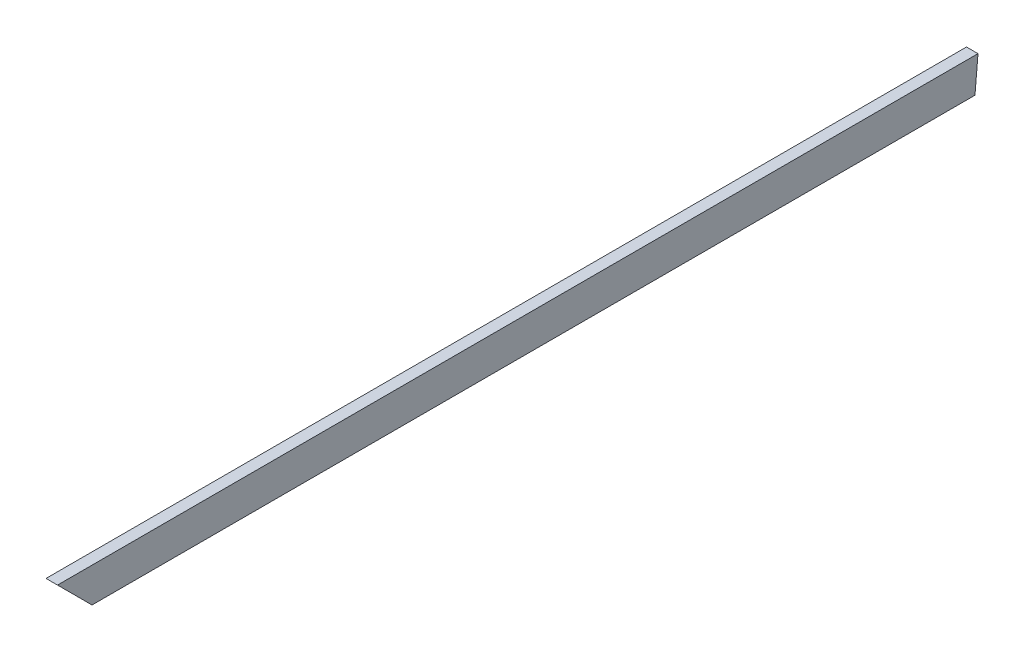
ISO-10303-21;
HEADER;
FILE_DESCRIPTION(('STEP AP214'),'2;1');
FILE_NAME('part.step','',(''),(''),'','','');
FILE_SCHEMA(('AUTOMOTIVE_DESIGN { 1 0 10303 214 1 1 1 1 }'));
ENDSEC;
DATA;
#1=APPLICATION_CONTEXT('core data for automotive mechanical design processes');
#2=APPLICATION_PROTOCOL_DEFINITION('international standard','automotive_design',2000,#1);
#3=PRODUCT_CONTEXT('',#1,'mechanical');
#4=PRODUCT('Part','Part','',(#3));
#5=PRODUCT_RELATED_PRODUCT_CATEGORY('part','',(#4));
#6=PRODUCT_DEFINITION_FORMATION('','',#4);
#7=PRODUCT_DEFINITION_CONTEXT('part definition',#1,'design');
#8=PRODUCT_DEFINITION('design','',#6,#7);
#9=PRODUCT_DEFINITION_SHAPE('','',#8);
#10=(LENGTH_UNIT() NAMED_UNIT(*) SI_UNIT(.MILLI.,.METRE.));
#11=(NAMED_UNIT(*) PLANE_ANGLE_UNIT() SI_UNIT($,.RADIAN.));
#12=(NAMED_UNIT(*) SI_UNIT($,.STERADIAN.) SOLID_ANGLE_UNIT());
#13=UNCERTAINTY_MEASURE_WITH_UNIT(LENGTH_MEASURE(1.E-05),#10,'distance_accuracy_value','');
#14=(GEOMETRIC_REPRESENTATION_CONTEXT(3) GLOBAL_UNCERTAINTY_ASSIGNED_CONTEXT((#13)) GLOBAL_UNIT_ASSIGNED_CONTEXT((#10,
#11,#12)) REPRESENTATION_CONTEXT('',''));
#15=CARTESIAN_POINT('',(0.,0.,0.));
#16=DIRECTION('',(0.,0.,1.));
#17=DIRECTION('',(1.,0.,0.));
#18=AXIS2_PLACEMENT_3D('',#15,#16,#17);
#19=CARTESIAN_POINT('',(0.,0.,2000.));
#20=DIRECTION('',(1.,0.,0.));
#21=DIRECTION('',(0.,0.,-1.));
#22=AXIS2_PLACEMENT_3D('',#19,#20,#21);
#23=PLANE('',#22);
#24=DIRECTION('',(0.,0.,-1.));
#25=VECTOR('',#24,1.);
#26=CARTESIAN_POINT('',(0.,150.,2000.));
#27=LINE('',#26,#25);
#28=CARTESIAN_POINT('',(0.,150.,2000.));
#29=VERTEX_POINT('',#28);
#30=CARTESIAN_POINT('',(0.,150.,-2000.));
#31=VERTEX_POINT('',#30);
#32=EDGE_CURVE('E120',#29,#31,#27,.T.);
#33=ORIENTED_EDGE('',*,*,#32,.T.);
#34=DIRECTION('',(0.,-0.996194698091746,0.0871557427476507));
#35=VECTOR('',#34,1.);
#36=CARTESIAN_POINT('',(0.,0.,-1986.87670047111));
#37=LINE('',#36,#35);
#38=CARTESIAN_POINT('',(0.,0.,-1986.87670047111));
#39=VERTEX_POINT('',#38);
#40=EDGE_CURVE('E104',#31,#39,#37,.T.);
#41=ORIENTED_EDGE('',*,*,#40,.T.);
#42=DIRECTION('',(0.,0.,-1.));
#43=VECTOR('',#42,1.);
#44=CARTESIAN_POINT('',(0.,0.,2000.));
#45=LINE('',#44,#43);
#46=CARTESIAN_POINT('',(0.,0.,1850.));
#47=VERTEX_POINT('',#46);
#48=EDGE_CURVE('E118',#47,#39,#45,.T.);
#49=ORIENTED_EDGE('',*,*,#48,.F.);
#50=DIRECTION('',(0.,0.707106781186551,0.707106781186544));
#51=VECTOR('',#50,1.);
#52=CARTESIAN_POINT('',(0.,0.,1850.));
#53=LINE('',#52,#51);
#54=EDGE_CURVE('E162',#47,#29,#53,.T.);
#55=ORIENTED_EDGE('',*,*,#54,.T.);
#56=EDGE_LOOP('',(#33,#41,#49,#55));
#57=FACE_BOUND('',#56,.T.);
#58=ADVANCED_FACE('F33',(#57),#23,.F.);
#59=CARTESIAN_POINT('',(0.,0.,2000.));
#60=DIRECTION('',(0.,1.,0.));
#61=DIRECTION('',(0.,0.,1.));
#62=AXIS2_PLACEMENT_3D('',#59,#60,#61);
#63=PLANE('',#62);
#64=ORIENTED_EDGE('',*,*,#48,.T.);
#65=DIRECTION('',(1.,0.,0.));
#66=VECTOR('',#65,1.);
#67=CARTESIAN_POINT('',(0.,0.,-1986.87670047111));
#68=LINE('',#67,#66);
#69=CARTESIAN_POINT('',(50.,0.,-1986.87670047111));
#70=VERTEX_POINT('',#69);
#71=EDGE_CURVE('E101',#39,#70,#68,.T.);
#72=ORIENTED_EDGE('',*,*,#71,.T.);
#73=DIRECTION('',(0.,0.,-1.));
#74=VECTOR('',#73,1.);
#75=CARTESIAN_POINT('',(50.,0.,2000.));
#76=LINE('',#75,#74);
#77=CARTESIAN_POINT('',(50.,0.,1850.));
#78=VERTEX_POINT('',#77);
#79=EDGE_CURVE('E125',#78,#70,#76,.T.);
#80=ORIENTED_EDGE('',*,*,#79,.F.);
#81=DIRECTION('',(1.,0.,0.));
#82=VECTOR('',#81,1.);
#83=CARTESIAN_POINT('',(0.,0.,1850.));
#84=LINE('',#83,#82);
#85=EDGE_CURVE('E124',#47,#78,#84,.T.);
#86=ORIENTED_EDGE('',*,*,#85,.F.);
#87=EDGE_LOOP('',(#64,#72,#80,#86));
#88=FACE_BOUND('',#87,.T.);
#89=ADVANCED_FACE('F123',(#88),#63,.F.);
#90=CARTESIAN_POINT('',(50.,0.,2000.));
#91=DIRECTION('',(-1.,0.,0.));
#92=DIRECTION('',(0.,0.,1.));
#93=AXIS2_PLACEMENT_3D('',#90,#91,#92);
#94=PLANE('',#93);
#95=ORIENTED_EDGE('',*,*,#79,.T.);
#96=DIRECTION('',(0.,-0.996194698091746,0.0871557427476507));
#97=VECTOR('',#96,1.);
#98=CARTESIAN_POINT('',(50.,0.,-1986.87670047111));
#99=LINE('',#98,#97);
#100=CARTESIAN_POINT('',(50.,150.,-2000.));
#101=VERTEX_POINT('',#100);
#102=EDGE_CURVE('E107',#101,#70,#99,.T.);
#103=ORIENTED_EDGE('',*,*,#102,.F.);
#104=DIRECTION('',(0.,0.,-1.));
#105=VECTOR('',#104,1.);
#106=CARTESIAN_POINT('',(50.,150.,2000.));
#107=LINE('',#106,#105);
#108=CARTESIAN_POINT('',(50.,150.,2000.));
#109=VERTEX_POINT('',#108);
#110=EDGE_CURVE('E127',#109,#101,#107,.T.);
#111=ORIENTED_EDGE('',*,*,#110,.F.);
#112=DIRECTION('',(0.,0.707106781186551,0.707106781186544));
#113=VECTOR('',#112,1.);
#114=CARTESIAN_POINT('',(50.,0.,1850.));
#115=LINE('',#114,#113);
#116=EDGE_CURVE('E163',#78,#109,#115,.T.);
#117=ORIENTED_EDGE('',*,*,#116,.F.);
#118=EDGE_LOOP('',(#95,#103,#111,#117));
#119=FACE_BOUND('',#118,.T.);
#120=ADVANCED_FACE('F207',(#119),#94,.F.);
#121=CARTESIAN_POINT('',(0.,150.,2000.));
#122=DIRECTION('',(0.,-1.,0.));
#123=DIRECTION('',(0.,0.,-1.));
#124=AXIS2_PLACEMENT_3D('',#121,#122,#123);
#125=PLANE('',#124);
#126=DIRECTION('',(-1.,0.,0.));
#127=VECTOR('',#126,1.);
#128=CARTESIAN_POINT('',(0.,150.,-2000.));
#129=LINE('',#128,#127);
#130=EDGE_CURVE('E134',#101,#31,#129,.T.);
#131=ORIENTED_EDGE('',*,*,#130,.T.);
#132=ORIENTED_EDGE('',*,*,#32,.F.);
#133=DIRECTION('',(-1.,0.,0.));
#134=VECTOR('',#133,1.);
#135=CARTESIAN_POINT('',(0.,150.,2000.));
#136=LINE('',#135,#134);
#137=EDGE_CURVE('E133',#109,#29,#136,.T.);
#138=ORIENTED_EDGE('',*,*,#137,.F.);
#139=ORIENTED_EDGE('',*,*,#110,.T.);
#140=EDGE_LOOP('',(#131,#132,#138,#139));
#141=FACE_BOUND('',#140,.T.);
#142=ADVANCED_FACE('F200',(#141),#125,.F.);
#143=CARTESIAN_POINT('',(0.,0.,1850.));
#144=DIRECTION('',(0.,0.707106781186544,-0.707106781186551));
#145=DIRECTION('',(0.,0.707106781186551,0.707106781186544));
#146=AXIS2_PLACEMENT_3D('',#143,#144,#145);
#147=PLANE('',#146);
#148=DIRECTION('',(0.,0.707106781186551,0.707106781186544));
#149=VECTOR('',#148,1.);
#150=CARTESIAN_POINT('',(4.,74.9999999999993,1925.));
#151=LINE('',#150,#149);
#152=CARTESIAN_POINT('',(4.,4.,1854.));
#153=VERTEX_POINT('',#152);
#154=CARTESIAN_POINT('',(4.,146.,1996.));
#155=VERTEX_POINT('',#154);
#156=EDGE_CURVE('E54',#153,#155,#151,.T.);
#157=ORIENTED_EDGE('',*,*,#156,.T.);
#158=DIRECTION('',(1.,0.,0.));
#159=VECTOR('',#158,1.);
#160=CARTESIAN_POINT('',(0.,146.,1996.));
#161=LINE('',#160,#159);
#162=CARTESIAN_POINT('',(46.,146.,1996.));
#163=VERTEX_POINT('',#162);
#164=EDGE_CURVE('E40',#155,#163,#161,.T.);
#165=ORIENTED_EDGE('',*,*,#164,.T.);
#166=DIRECTION('',(0.,-0.707106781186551,-0.707106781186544));
#167=VECTOR('',#166,1.);
#168=CARTESIAN_POINT('',(46.,74.9999999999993,1925.));
#169=LINE('',#168,#167);
#170=CARTESIAN_POINT('',(46.,4.,1854.));
#171=VERTEX_POINT('',#170);
#172=EDGE_CURVE('E159',#163,#171,#169,.T.);
#173=ORIENTED_EDGE('',*,*,#172,.T.);
#174=DIRECTION('',(-1.,0.,0.));
#175=VECTOR('',#174,1.);
#176=CARTESIAN_POINT('',(0.,4.,1854.));
#177=LINE('',#176,#175);
#178=EDGE_CURVE('E157',#171,#153,#177,.T.);
#179=ORIENTED_EDGE('',*,*,#178,.T.);
#180=EDGE_LOOP('',(#157,#165,#173,#179));
#181=FACE_BOUND('',#180,.T.);
#182=ORIENTED_EDGE('',*,*,#116,.T.);
#183=ORIENTED_EDGE('',*,*,#137,.T.);
#184=ORIENTED_EDGE('',*,*,#54,.F.);
#185=ORIENTED_EDGE('',*,*,#85,.T.);
#186=EDGE_LOOP('',(#182,#183,#184,#185));
#187=FACE_BOUND('',#186,.T.);
#188=ADVANCED_FACE('F181',(#181,#187),#147,.F.);
#189=CARTESIAN_POINT('',(0.,0.,-1996.));
#190=DIRECTION('',(0.,0.,-1.));
#191=DIRECTION('',(-1.,0.,0.));
#192=AXIS2_PLACEMENT_3D('',#189,#190,#191);
#193=PLANE('',#192);
#194=DIRECTION('',(0.,-1.,0.));
#195=VECTOR('',#194,1.);
#196=CARTESIAN_POINT('',(4.,0.,-1996.));
#197=LINE('',#196,#195);
#198=CARTESIAN_POINT('',(4.,146.,-1996.));
#199=VERTEX_POINT('',#198);
#200=CARTESIAN_POINT('',(4.,104.279790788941,-1996.));
#201=VERTEX_POINT('',#200);
#202=EDGE_CURVE('E148',#199,#201,#197,.T.);
#203=ORIENTED_EDGE('',*,*,#202,.T.);
#204=DIRECTION('',(1.,0.,0.));
#205=VECTOR('',#204,1.);
#206=CARTESIAN_POINT('',(0.,104.279790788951,-1996.));
#207=LINE('',#206,#205);
#208=CARTESIAN_POINT('',(46.,104.279790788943,-1996.));
#209=VERTEX_POINT('',#208);
#210=EDGE_CURVE('E46',#201,#209,#207,.T.);
#211=ORIENTED_EDGE('',*,*,#210,.T.);
#212=DIRECTION('',(0.,1.,0.));
#213=VECTOR('',#212,1.);
#214=CARTESIAN_POINT('',(46.,0.,-1996.));
#215=LINE('',#214,#213);
#216=CARTESIAN_POINT('',(46.,146.,-1996.));
#217=VERTEX_POINT('',#216);
#218=EDGE_CURVE('E142',#209,#217,#215,.T.);
#219=ORIENTED_EDGE('',*,*,#218,.T.);
#220=DIRECTION('',(-1.,0.,0.));
#221=VECTOR('',#220,1.);
#222=CARTESIAN_POINT('',(0.,146.,-1996.));
#223=LINE('',#222,#221);
#224=EDGE_CURVE('E138',#217,#199,#223,.T.);
#225=ORIENTED_EDGE('',*,*,#224,.T.);
#226=EDGE_LOOP('',(#203,#211,#219,#225));
#227=FACE_BOUND('',#226,.T.);
#228=ADVANCED_FACE('F192',(#227),#193,.F.);
#229=CARTESIAN_POINT('',(0.,146.,2000.));
#230=DIRECTION('',(0.,-1.,0.));
#231=DIRECTION('',(0.,0.,-1.));
#232=AXIS2_PLACEMENT_3D('',#229,#230,#231);
#233=PLANE('',#232);
#234=ORIENTED_EDGE('',*,*,#164,.F.);
#235=DIRECTION('',(0.,0.,-1.));
#236=VECTOR('',#235,1.);
#237=CARTESIAN_POINT('',(4.,146.,2000.));
#238=LINE('',#237,#236);
#239=EDGE_CURVE('E141',#155,#199,#238,.T.);
#240=ORIENTED_EDGE('',*,*,#239,.T.);
#241=ORIENTED_EDGE('',*,*,#224,.F.);
#242=DIRECTION('',(0.,0.,-1.));
#243=VECTOR('',#242,1.);
#244=CARTESIAN_POINT('',(46.,146.,2000.));
#245=LINE('',#244,#243);
#246=EDGE_CURVE('E143',#163,#217,#245,.T.);
#247=ORIENTED_EDGE('',*,*,#246,.F.);
#248=EDGE_LOOP('',(#234,#240,#241,#247));
#249=FACE_BOUND('',#248,.T.);
#250=ADVANCED_FACE('F189',(#249),#233,.T.);
#251=CARTESIAN_POINT('',(46.,0.,2000.));
#252=DIRECTION('',(-1.,0.,0.));
#253=DIRECTION('',(0.,0.,1.));
#254=AXIS2_PLACEMENT_3D('',#251,#252,#253);
#255=PLANE('',#254);
#256=DIRECTION('',(0.,0.996194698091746,-0.0871557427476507));
#257=VECTOR('',#256,1.);
#258=CARTESIAN_POINT('',(46.,-346.156936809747,-1956.5918926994));
#259=LINE('',#258,#257);
#260=CARTESIAN_POINT('',(46.,4.,-1987.22665512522));
#261=VERTEX_POINT('',#260);
#262=EDGE_CURVE('E167',#261,#209,#259,.T.);
#263=ORIENTED_EDGE('',*,*,#262,.F.);
#264=DIRECTION('',(0.,0.,-1.));
#265=VECTOR('',#264,1.);
#266=CARTESIAN_POINT('',(46.,4.,2000.));
#267=LINE('',#266,#265);
#268=EDGE_CURVE('E146',#171,#261,#267,.T.);
#269=ORIENTED_EDGE('',*,*,#268,.F.);
#270=ORIENTED_EDGE('',*,*,#172,.F.);
#271=ORIENTED_EDGE('',*,*,#246,.T.);
#272=ORIENTED_EDGE('',*,*,#218,.F.);
#273=EDGE_LOOP('',(#263,#269,#270,#271,#272));
#274=FACE_BOUND('',#273,.T.);
#275=ADVANCED_FACE('F177',(#274),#255,.T.);
#276=CARTESIAN_POINT('',(0.,4.,2000.));
#277=DIRECTION('',(0.,1.,0.));
#278=DIRECTION('',(0.,0.,1.));
#279=AXIS2_PLACEMENT_3D('',#276,#277,#278);
#280=PLANE('',#279);
#281=DIRECTION('',(1.,0.,0.));
#282=VECTOR('',#281,1.);
#283=CARTESIAN_POINT('',(0.,4.,-1987.22665512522));
#284=LINE('',#283,#282);
#285=CARTESIAN_POINT('',(4.,3.99999999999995,-1987.22665512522));
#286=VERTEX_POINT('',#285);
#287=EDGE_CURVE('E112',#286,#261,#284,.T.);
#288=ORIENTED_EDGE('',*,*,#287,.F.);
#289=DIRECTION('',(0.,0.,-1.));
#290=VECTOR('',#289,1.);
#291=CARTESIAN_POINT('',(4.,4.,2000.));
#292=LINE('',#291,#290);
#293=EDGE_CURVE('E136',#153,#286,#292,.T.);
#294=ORIENTED_EDGE('',*,*,#293,.F.);
#295=ORIENTED_EDGE('',*,*,#178,.F.);
#296=ORIENTED_EDGE('',*,*,#268,.T.);
#297=EDGE_LOOP('',(#288,#294,#295,#296));
#298=FACE_BOUND('',#297,.T.);
#299=ADVANCED_FACE('F180',(#298),#280,.T.);
#300=CARTESIAN_POINT('',(4.,0.,2000.));
#301=DIRECTION('',(1.,0.,0.));
#302=DIRECTION('',(0.,0.,-1.));
#303=AXIS2_PLACEMENT_3D('',#300,#301,#302);
#304=PLANE('',#303);
#305=DIRECTION('',(0.,-0.996194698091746,0.0871557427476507));
#306=VECTOR('',#305,1.);
#307=CARTESIAN_POINT('',(4.,-346.156936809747,-1956.5918926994));
#308=LINE('',#307,#306);
#309=EDGE_CURVE('E11',#201,#286,#308,.T.);
#310=ORIENTED_EDGE('',*,*,#309,.F.);
#311=ORIENTED_EDGE('',*,*,#202,.F.);
#312=ORIENTED_EDGE('',*,*,#239,.F.);
#313=ORIENTED_EDGE('',*,*,#156,.F.);
#314=ORIENTED_EDGE('',*,*,#293,.T.);
#315=EDGE_LOOP('',(#310,#311,#312,#313,#314));
#316=FACE_BOUND('',#315,.T.);
#317=ADVANCED_FACE('F185',(#316),#304,.T.);
#318=CARTESIAN_POINT('',(0.,0.,-1986.87670047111));
#319=DIRECTION('',(0.,0.0871557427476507,0.996194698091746));
#320=DIRECTION('',(0.,-0.996194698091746,0.0871557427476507));
#321=AXIS2_PLACEMENT_3D('',#318,#319,#320);
#322=PLANE('',#321);
#323=ORIENTED_EDGE('',*,*,#102,.T.);
#324=ORIENTED_EDGE('',*,*,#71,.F.);
#325=ORIENTED_EDGE('',*,*,#40,.F.);
#326=ORIENTED_EDGE('',*,*,#130,.F.);
#327=EDGE_LOOP('',(#323,#324,#325,#326));
#328=FACE_BOUND('',#327,.T.);
#329=ORIENTED_EDGE('',*,*,#309,.T.);
#330=ORIENTED_EDGE('',*,*,#287,.T.);
#331=ORIENTED_EDGE('',*,*,#262,.T.);
#332=ORIENTED_EDGE('',*,*,#210,.F.);
#333=EDGE_LOOP('',(#329,#330,#331,#332));
#334=FACE_BOUND('',#333,.T.);
#335=ADVANCED_FACE('F103',(#328,#334),#322,.F.);
#336=CLOSED_SHELL('',(#58,#89,#120,#142,#188,#228,#250,#275,#299,#317,#335));
#337=MANIFOLD_SOLID_BREP('B2',#336);
#338=ADVANCED_BREP_SHAPE_REPRESENTATION('',(#18,#337),#14);
#339=SHAPE_DEFINITION_REPRESENTATION(#9,#338);
ENDSEC;
END-ISO-10303-21;
